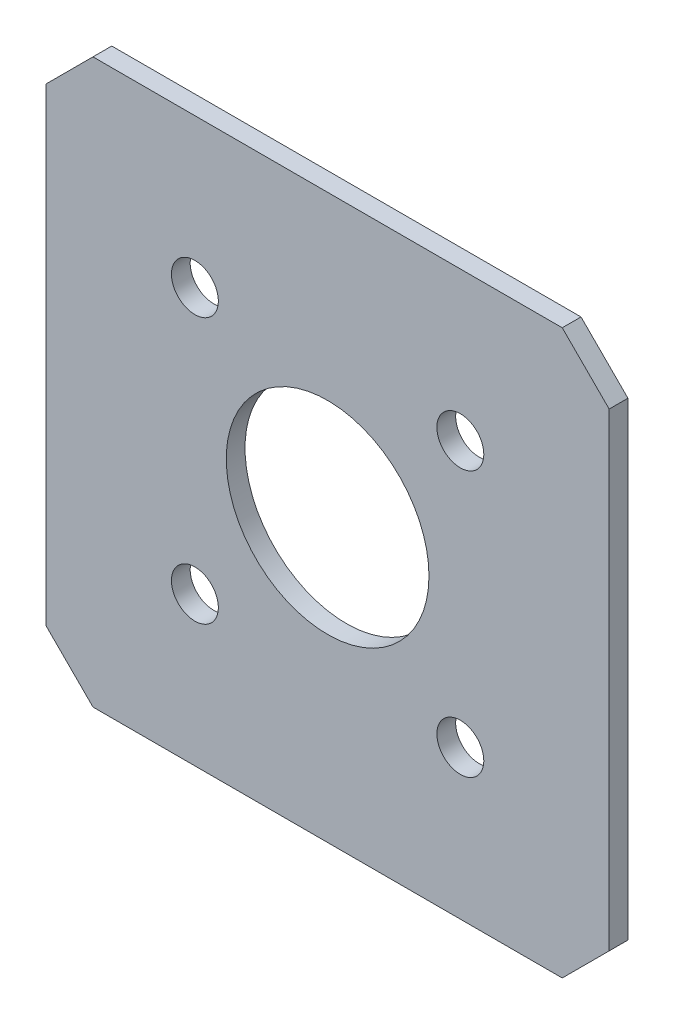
from build123d import *

# Parameters (mm, degrees)
ESQUISSE1_R        = 12.5
ESQUISSE1_R_2      = 54
BOSS_EXTRU_1_DEPTH = 10


with BuildPart() as part:
    # Esquisse1 → Boss.-Extru.1 (new body)
    with BuildSketch(Plane.XY):
        Polygon((-150, 125), (-125, 150), (125, 150), (150, 125), (150, -125), (125, -150), (-125, -150), (-150, -125), align=None)
        with Locations((-70.710678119, 70.710678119)):
            Circle(ESQUISSE1_R, mode=Mode.SUBTRACT)
        with Locations((70.710678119, 70.710678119)):
            Circle(ESQUISSE1_R, mode=Mode.SUBTRACT)
        with Locations((70.710678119, -70.710678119)):
            Circle(ESQUISSE1_R, mode=Mode.SUBTRACT)
        with Locations((-70.710678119, -70.710678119)):
            Circle(ESQUISSE1_R, mode=Mode.SUBTRACT)
        Circle(ESQUISSE1_R_2, mode=Mode.SUBTRACT)
    extrude(amount=BOSS_EXTRU_1_DEPTH)


solid = part.part
